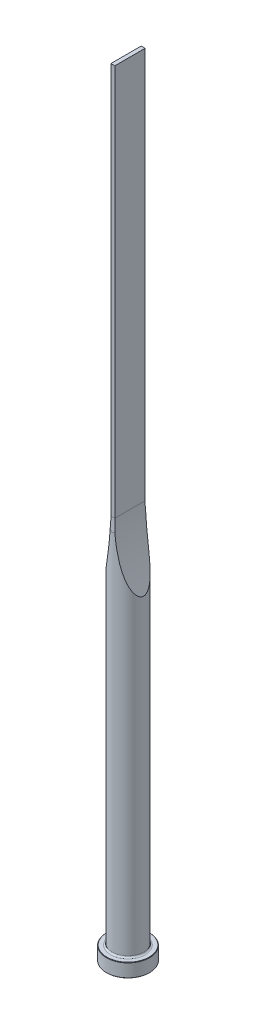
from build123d import *

# Parameters (mm, degrees)
CUT_EXTRUDE1_DEPTH = 10
CUT_EXTRUDE2_DEPTH = 10


with BuildPart() as part:
    # Sketch1 → Revolve1 (revolve)
    with BuildSketch(Plane.XY, mode=Mode.PRIVATE) as revolve1_sk:
        with BuildLine():
            Line((0, 0), (10.8, 0))
            Line((10.8, 0), (11, 0.2))
            Line((11, 0.2), (11, 6.8))
            Line((11, 6.8), (10.8, 7))
            Line((10.8, 7), (8.8, 7))
            ThreePointArc((8.8, 7), (8.234314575, 7.234314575), (8, 7.8))
            Line((8, 7.8), (8, 400))
            Line((8, 400), (0, 400))
            Line((0, 400), (0, 0))
        make_face()
    revolve(revolve1_sk.sketch.rotate(Axis((0, 400, 0), (0, -1, 0)), 180), axis=Axis((0, 400, 0), (0, -1, 0)))

    # Sketch2 → Cut-Extrude1 (cut, symmetric)
    with BuildSketch(Plane.XY):
        with BuildLine():
            Line((1, 400), (1, 200))
            ThreePointArc((1, 200), (2.767352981, 182.251760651), (8, 165.200574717))
            Line((8, 165.200574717), (8, 400))
            Line((8, 400), (1, 400))
        make_face()
        with BuildLine():
            Line((-1, 400), (-1, 200))
            ThreePointArc((-1, 200), (-2.767352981, 182.251760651), (-8, 165.200574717))
            Line((-8, 165.200574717), (-8, 400))
            Line((-8, 400), (-1, 400))
        make_face()
    extrude(amount=CUT_EXTRUDE1_DEPTH, both=True, mode=Mode.SUBTRACT)

    # Sketch3 → Cut-Extrude2 (cut, symmetric)
    with BuildSketch(Plane(origin=(0, 0, 0), x_dir=(0, 0, -1), z_dir=(1, 0, 0))):
        with BuildLine():
            Line((7.75, 400), (7.75, 200))
            ThreePointArc((7.75, 200), (7.812521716, 196.645898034), (8, 193.296456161))
            Line((8, 193.296456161), (8, 400))
            Line((8, 400), (7.75, 400))
        make_face()
        with BuildLine():
            Line((-7.75, 400), (-7.75, 200))
            ThreePointArc((-7.75, 200), (-7.812521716, 196.645898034), (-8, 193.296456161))
            Line((-8, 193.296456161), (-8, 400))
            Line((-8, 400), (-7.75, 400))
        make_face()
    extrude(amount=CUT_EXTRUDE2_DEPTH, both=True, mode=Mode.SUBTRACT)


solid = part.part
